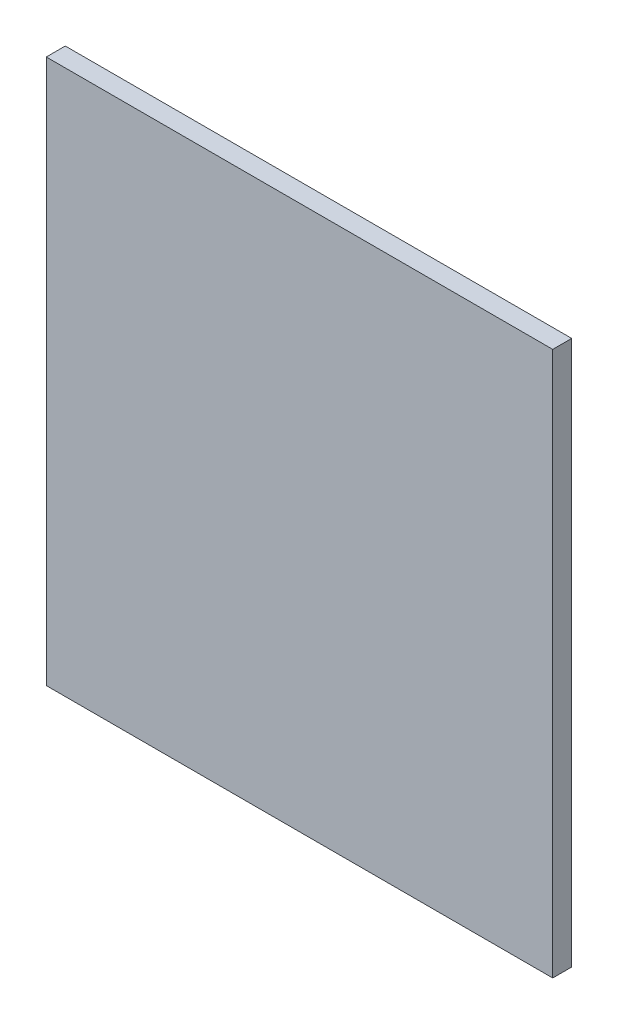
ISO-10303-21;
HEADER;
FILE_DESCRIPTION(('STEP AP214'),'2;1');
FILE_NAME('part.step','',(''),(''),'','','');
FILE_SCHEMA(('AUTOMOTIVE_DESIGN { 1 0 10303 214 1 1 1 1 }'));
ENDSEC;
DATA;
#1=APPLICATION_CONTEXT('core data for automotive mechanical design processes');
#2=APPLICATION_PROTOCOL_DEFINITION('international standard','automotive_design',2000,#1);
#3=PRODUCT_CONTEXT('',#1,'mechanical');
#4=PRODUCT('Part','Part','',(#3));
#5=PRODUCT_RELATED_PRODUCT_CATEGORY('part','',(#4));
#6=PRODUCT_DEFINITION_FORMATION('','',#4);
#7=PRODUCT_DEFINITION_CONTEXT('part definition',#1,'design');
#8=PRODUCT_DEFINITION('design','',#6,#7);
#9=PRODUCT_DEFINITION_SHAPE('','',#8);
#10=(LENGTH_UNIT() NAMED_UNIT(*) SI_UNIT(.MILLI.,.METRE.));
#11=(NAMED_UNIT(*) PLANE_ANGLE_UNIT() SI_UNIT($,.RADIAN.));
#12=(NAMED_UNIT(*) SI_UNIT($,.STERADIAN.) SOLID_ANGLE_UNIT());
#13=UNCERTAINTY_MEASURE_WITH_UNIT(LENGTH_MEASURE(1.E-05),#10,'distance_accuracy_value','');
#14=(GEOMETRIC_REPRESENTATION_CONTEXT(3) GLOBAL_UNCERTAINTY_ASSIGNED_CONTEXT((#13)) GLOBAL_UNIT_ASSIGNED_CONTEXT((#10,
#11,#12)) REPRESENTATION_CONTEXT('',''));
#15=CARTESIAN_POINT('',(0.,0.,0.));
#16=DIRECTION('',(0.,0.,1.));
#17=DIRECTION('',(1.,0.,0.));
#18=AXIS2_PLACEMENT_3D('',#15,#16,#17);
#19=CARTESIAN_POINT('',(200.,215.,15.));
#20=DIRECTION('',(-1.,0.,0.));
#21=DIRECTION('',(0.,-1.,0.));
#22=AXIS2_PLACEMENT_3D('',#19,#20,#21);
#23=PLANE('',#22);
#24=DIRECTION('',(0.,1.,0.));
#25=VECTOR('',#24,1.);
#26=CARTESIAN_POINT('',(200.,215.,0.));
#27=LINE('',#26,#25);
#28=CARTESIAN_POINT('',(200.,-215.,0.));
#29=VERTEX_POINT('',#28);
#30=CARTESIAN_POINT('',(200.,215.,0.));
#31=VERTEX_POINT('',#30);
#32=EDGE_CURVE('E111',#29,#31,#27,.T.);
#33=ORIENTED_EDGE('',*,*,#32,.T.);
#34=DIRECTION('',(0.,0.,-1.));
#35=VECTOR('',#34,1.);
#36=CARTESIAN_POINT('',(200.,215.,15.));
#37=LINE('',#36,#35);
#38=CARTESIAN_POINT('',(200.,215.,15.));
#39=VERTEX_POINT('',#38);
#40=EDGE_CURVE('E11',#39,#31,#37,.T.);
#41=ORIENTED_EDGE('',*,*,#40,.F.);
#42=DIRECTION('',(0.,1.,0.));
#43=VECTOR('',#42,1.);
#44=CARTESIAN_POINT('',(200.,215.,15.));
#45=LINE('',#44,#43);
#46=CARTESIAN_POINT('',(200.,-215.,15.));
#47=VERTEX_POINT('',#46);
#48=EDGE_CURVE('E95',#47,#39,#45,.T.);
#49=ORIENTED_EDGE('',*,*,#48,.F.);
#50=DIRECTION('',(0.,0.,-1.));
#51=VECTOR('',#50,1.);
#52=CARTESIAN_POINT('',(200.,-215.,15.));
#53=LINE('',#52,#51);
#54=EDGE_CURVE('E107',#47,#29,#53,.T.);
#55=ORIENTED_EDGE('',*,*,#54,.T.);
#56=EDGE_LOOP('',(#33,#41,#49,#55));
#57=FACE_BOUND('',#56,.T.);
#58=ADVANCED_FACE('F43',(#57),#23,.F.);
#59=CARTESIAN_POINT('',(-200.,215.,15.));
#60=DIRECTION('',(0.,-1.,0.));
#61=DIRECTION('',(0.,0.,-1.));
#62=AXIS2_PLACEMENT_3D('',#59,#60,#61);
#63=PLANE('',#62);
#64=DIRECTION('',(-1.,0.,0.));
#65=VECTOR('',#64,1.);
#66=CARTESIAN_POINT('',(-200.,215.,0.));
#67=LINE('',#66,#65);
#68=CARTESIAN_POINT('',(-200.,215.,0.));
#69=VERTEX_POINT('',#68);
#70=EDGE_CURVE('E100',#31,#69,#67,.T.);
#71=ORIENTED_EDGE('',*,*,#70,.T.);
#72=DIRECTION('',(0.,0.,-1.));
#73=VECTOR('',#72,1.);
#74=CARTESIAN_POINT('',(-200.,215.,15.));
#75=LINE('',#74,#73);
#76=CARTESIAN_POINT('',(-200.,215.,15.));
#77=VERTEX_POINT('',#76);
#78=EDGE_CURVE('E52',#77,#69,#75,.T.);
#79=ORIENTED_EDGE('',*,*,#78,.F.);
#80=DIRECTION('',(-1.,0.,0.));
#81=VECTOR('',#80,1.);
#82=CARTESIAN_POINT('',(-200.,215.,15.));
#83=LINE('',#82,#81);
#84=EDGE_CURVE('E90',#39,#77,#83,.T.);
#85=ORIENTED_EDGE('',*,*,#84,.F.);
#86=ORIENTED_EDGE('',*,*,#40,.T.);
#87=EDGE_LOOP('',(#71,#79,#85,#86));
#88=FACE_BOUND('',#87,.T.);
#89=ADVANCED_FACE('F99',(#88),#63,.F.);
#90=CARTESIAN_POINT('',(-200.,215.,15.));
#91=DIRECTION('',(1.,0.,0.));
#92=DIRECTION('',(0.,1.,0.));
#93=AXIS2_PLACEMENT_3D('',#90,#91,#92);
#94=PLANE('',#93);
#95=DIRECTION('',(0.,-1.,0.));
#96=VECTOR('',#95,1.);
#97=CARTESIAN_POINT('',(-200.,215.,0.));
#98=LINE('',#97,#96);
#99=CARTESIAN_POINT('',(-200.,-215.,0.));
#100=VERTEX_POINT('',#99);
#101=EDGE_CURVE('E77',#69,#100,#98,.T.);
#102=ORIENTED_EDGE('',*,*,#101,.T.);
#103=DIRECTION('',(0.,0.,-1.));
#104=VECTOR('',#103,1.);
#105=CARTESIAN_POINT('',(-200.,-215.,15.));
#106=LINE('',#105,#104);
#107=CARTESIAN_POINT('',(-200.,-215.,15.));
#108=VERTEX_POINT('',#107);
#109=EDGE_CURVE('E102',#108,#100,#106,.T.);
#110=ORIENTED_EDGE('',*,*,#109,.F.);
#111=DIRECTION('',(0.,-1.,0.));
#112=VECTOR('',#111,1.);
#113=CARTESIAN_POINT('',(-200.,215.,15.));
#114=LINE('',#113,#112);
#115=EDGE_CURVE('E93',#77,#108,#114,.T.);
#116=ORIENTED_EDGE('',*,*,#115,.F.);
#117=ORIENTED_EDGE('',*,*,#78,.T.);
#118=EDGE_LOOP('',(#102,#110,#116,#117));
#119=FACE_BOUND('',#118,.T.);
#120=ADVANCED_FACE('F103',(#119),#94,.F.);
#121=CARTESIAN_POINT('',(-200.,-215.,15.));
#122=DIRECTION('',(0.,1.,0.));
#123=DIRECTION('',(0.,0.,1.));
#124=AXIS2_PLACEMENT_3D('',#121,#122,#123);
#125=PLANE('',#124);
#126=DIRECTION('',(1.,0.,0.));
#127=VECTOR('',#126,1.);
#128=CARTESIAN_POINT('',(-200.,-215.,0.));
#129=LINE('',#128,#127);
#130=EDGE_CURVE('E83',#100,#29,#129,.T.);
#131=ORIENTED_EDGE('',*,*,#130,.T.);
#132=ORIENTED_EDGE('',*,*,#54,.F.);
#133=DIRECTION('',(1.,0.,0.));
#134=VECTOR('',#133,1.);
#135=CARTESIAN_POINT('',(-200.,-215.,15.));
#136=LINE('',#135,#134);
#137=EDGE_CURVE('E60',#108,#47,#136,.T.);
#138=ORIENTED_EDGE('',*,*,#137,.F.);
#139=ORIENTED_EDGE('',*,*,#109,.T.);
#140=EDGE_LOOP('',(#131,#132,#138,#139));
#141=FACE_BOUND('',#140,.T.);
#142=ADVANCED_FACE('F124',(#141),#125,.F.);
#143=CARTESIAN_POINT('',(0.,0.,15.));
#144=DIRECTION('',(0.,0.,1.));
#145=DIRECTION('',(1.,0.,0.));
#146=AXIS2_PLACEMENT_3D('',#143,#144,#145);
#147=PLANE('',#146);
#148=ORIENTED_EDGE('',*,*,#48,.T.);
#149=ORIENTED_EDGE('',*,*,#84,.T.);
#150=ORIENTED_EDGE('',*,*,#115,.T.);
#151=ORIENTED_EDGE('',*,*,#137,.T.);
#152=EDGE_LOOP('',(#148,#149,#150,#151));
#153=FACE_BOUND('',#152,.T.);
#154=ADVANCED_FACE('F91',(#153),#147,.T.);
#155=CARTESIAN_POINT('',(0.,0.,0.));
#156=DIRECTION('',(0.,0.,1.));
#157=DIRECTION('',(1.,0.,0.));
#158=AXIS2_PLACEMENT_3D('',#155,#156,#157);
#159=PLANE('',#158);
#160=ORIENTED_EDGE('',*,*,#32,.F.);
#161=ORIENTED_EDGE('',*,*,#130,.F.);
#162=ORIENTED_EDGE('',*,*,#101,.F.);
#163=ORIENTED_EDGE('',*,*,#70,.F.);
#164=EDGE_LOOP('',(#160,#161,#162,#163));
#165=FACE_BOUND('',#164,.T.);
#166=ADVANCED_FACE('F127',(#165),#159,.F.);
#167=CLOSED_SHELL('',(#58,#89,#120,#142,#154,#166));
#168=MANIFOLD_SOLID_BREP('B2',#167);
#169=ADVANCED_BREP_SHAPE_REPRESENTATION('',(#18,#168),#14);
#170=SHAPE_DEFINITION_REPRESENTATION(#9,#169);
ENDSEC;
END-ISO-10303-21;
